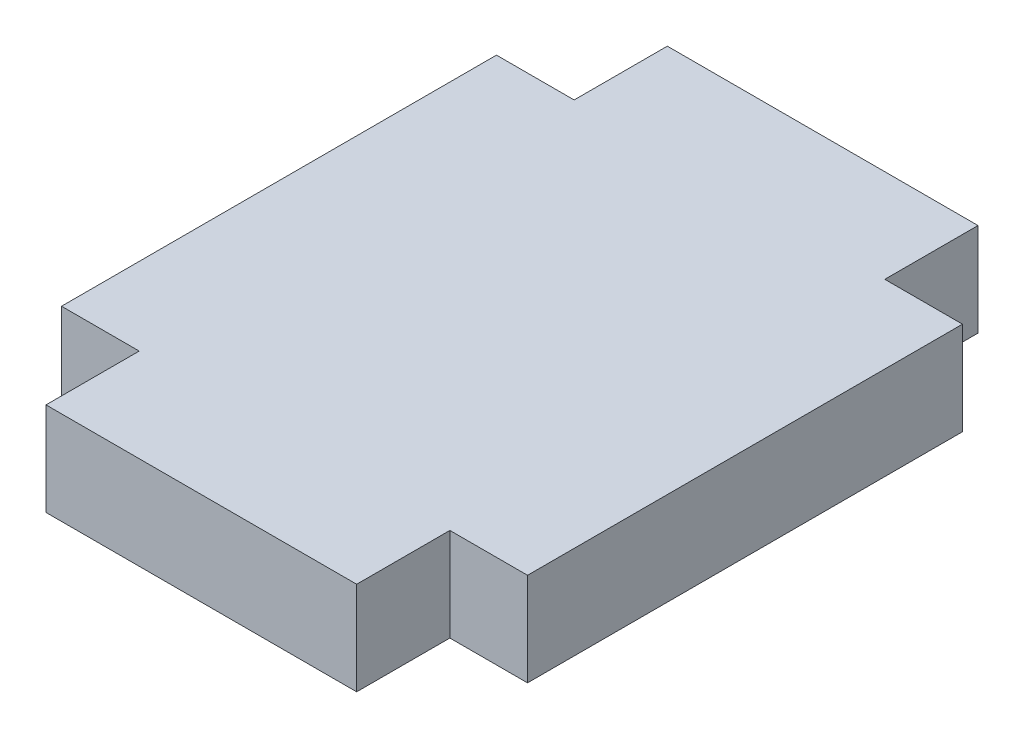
from build123d import *

# Parameters (mm, degrees)
Y_KSEKLIK_EKSTR_ZYON1_DEPTH = 6


with BuildPart() as part:
    # izim1 → Y_kseklik-Ekstr_zyon1 (new body)
    with BuildSketch(Plane(origin=(0, 0, 0), x_dir=(1, 0, 0), z_dir=(0, 1, 0))):
        Polygon((-10, 14), (-10, 20), (10, 20), (10, 14), (15, 14), (15, -14), (10, -14), (10, -20), (-10, -20), (-10, -14), (-15, -14), (-15, 14), align=None)
    extrude(amount=Y_KSEKLIK_EKSTR_ZYON1_DEPTH)


solid = part.part
